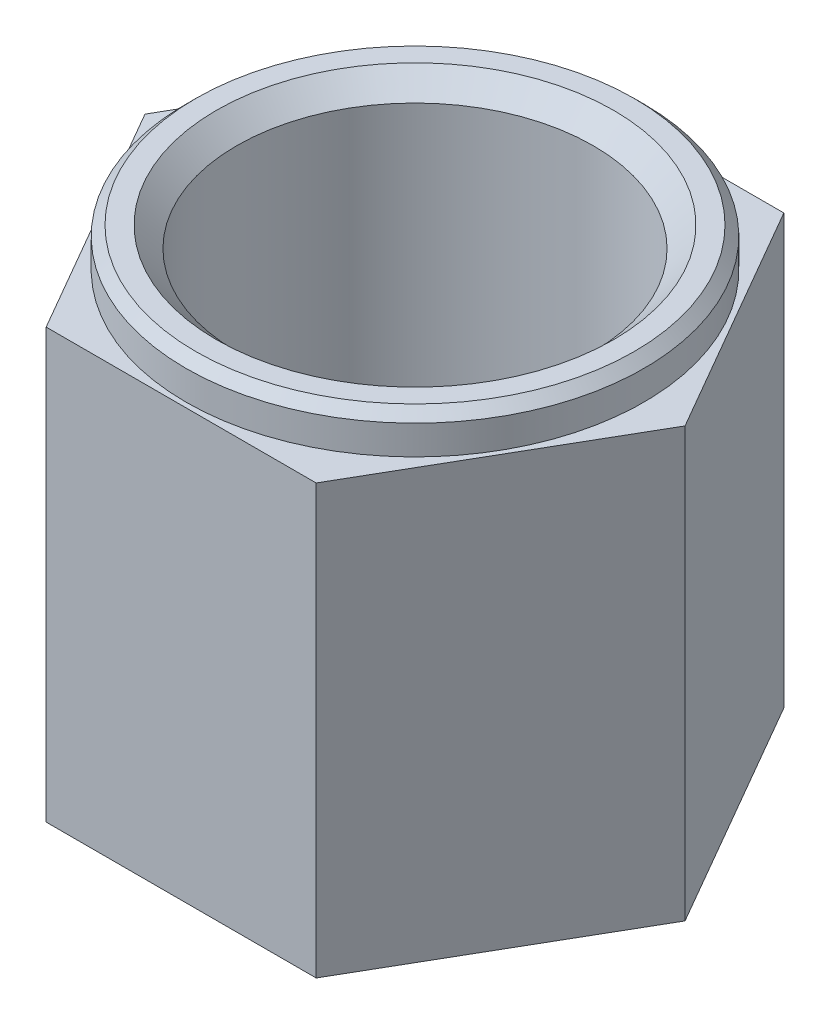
ISO-10303-21;
HEADER;
FILE_DESCRIPTION(('STEP AP214'),'2;1');
FILE_NAME('part.step','',(''),(''),'','','');
FILE_SCHEMA(('AUTOMOTIVE_DESIGN { 1 0 10303 214 1 1 1 1 }'));
ENDSEC;
DATA;
#1=APPLICATION_CONTEXT('core data for automotive mechanical design processes');
#2=APPLICATION_PROTOCOL_DEFINITION('international standard','automotive_design',2000,#1);
#3=PRODUCT_CONTEXT('',#1,'mechanical');
#4=PRODUCT('Part','Part','',(#3));
#5=PRODUCT_RELATED_PRODUCT_CATEGORY('part','',(#4));
#6=PRODUCT_DEFINITION_FORMATION('','',#4);
#7=PRODUCT_DEFINITION_CONTEXT('part definition',#1,'design');
#8=PRODUCT_DEFINITION('design','',#6,#7);
#9=PRODUCT_DEFINITION_SHAPE('','',#8);
#10=(LENGTH_UNIT() NAMED_UNIT(*) SI_UNIT(.MILLI.,.METRE.));
#11=(NAMED_UNIT(*) PLANE_ANGLE_UNIT() SI_UNIT($,.RADIAN.));
#12=(NAMED_UNIT(*) SI_UNIT($,.STERADIAN.) SOLID_ANGLE_UNIT());
#13=UNCERTAINTY_MEASURE_WITH_UNIT(LENGTH_MEASURE(1.E-05),#10,'distance_accuracy_value','');
#14=(GEOMETRIC_REPRESENTATION_CONTEXT(3) GLOBAL_UNCERTAINTY_ASSIGNED_CONTEXT((#13)) GLOBAL_UNIT_ASSIGNED_CONTEXT((#10,
#11,#12)) REPRESENTATION_CONTEXT('',''));
#15=CARTESIAN_POINT('',(0.,0.,0.));
#16=DIRECTION('',(0.,0.,1.));
#17=DIRECTION('',(1.,0.,0.));
#18=AXIS2_PLACEMENT_3D('',#15,#16,#17);
#19=CARTESIAN_POINT('',(6.92820323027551,24.,12.));
#20=DIRECTION('',(-0.866025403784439,0.,-0.5));
#21=DIRECTION('',(-0.5,0.,0.866025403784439));
#22=AXIS2_PLACEMENT_3D('',#19,#20,#21);
#23=PLANE('',#22);
#24=DIRECTION('',(0.,-1.,0.));
#25=VECTOR('',#24,1.);
#26=CARTESIAN_POINT('',(13.856406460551,24.,0.));
#27=LINE('',#26,#25);
#28=CARTESIAN_POINT('',(13.856406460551,22.,0.));
#29=VERTEX_POINT('',#28);
#30=CARTESIAN_POINT('',(13.856406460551,0.,0.));
#31=VERTEX_POINT('',#30);
#32=EDGE_CURVE('E92',#29,#31,#27,.T.);
#33=ORIENTED_EDGE('',*,*,#32,.F.);
#34=DIRECTION('',(-0.5,0.,0.866025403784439));
#35=VECTOR('',#34,1.);
#36=CARTESIAN_POINT('',(6.92820323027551,22.,12.));
#37=LINE('',#36,#35);
#38=CARTESIAN_POINT('',(6.92820323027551,22.,12.));
#39=VERTEX_POINT('',#38);
#40=EDGE_CURVE('E88',#29,#39,#37,.T.);
#41=ORIENTED_EDGE('',*,*,#40,.T.);
#42=DIRECTION('',(0.,-1.,0.));
#43=VECTOR('',#42,1.);
#44=CARTESIAN_POINT('',(6.92820323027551,24.,12.));
#45=LINE('',#44,#43);
#46=CARTESIAN_POINT('',(6.92820323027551,0.,12.));
#47=VERTEX_POINT('',#46);
#48=EDGE_CURVE('E57',#39,#47,#45,.T.);
#49=ORIENTED_EDGE('',*,*,#48,.T.);
#50=DIRECTION('',(0.5,0.,-0.866025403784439));
#51=VECTOR('',#50,1.);
#52=CARTESIAN_POINT('',(6.92820323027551,0.,12.));
#53=LINE('',#52,#51);
#54=EDGE_CURVE('E241',#47,#31,#53,.T.);
#55=ORIENTED_EDGE('',*,*,#54,.T.);
#56=EDGE_LOOP('',(#33,#41,#49,#55));
#57=FACE_BOUND('',#56,.T.);
#58=ADVANCED_FACE('F34',(#57),#23,.F.);
#59=CARTESIAN_POINT('',(13.856406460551,24.,0.));
#60=DIRECTION('',(-0.866025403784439,0.,0.5));
#61=DIRECTION('',(0.5,0.,0.866025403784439));
#62=AXIS2_PLACEMENT_3D('',#59,#60,#61);
#63=PLANE('',#62);
#64=DIRECTION('',(0.,-1.,0.));
#65=VECTOR('',#64,1.);
#66=CARTESIAN_POINT('',(6.9282032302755,24.,-12.));
#67=LINE('',#66,#65);
#68=CARTESIAN_POINT('',(6.9282032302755,22.,-12.));
#69=VERTEX_POINT('',#68);
#70=CARTESIAN_POINT('',(6.9282032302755,0.,-12.));
#71=VERTEX_POINT('',#70);
#72=EDGE_CURVE('E113',#69,#71,#67,.T.);
#73=ORIENTED_EDGE('',*,*,#72,.F.);
#74=DIRECTION('',(0.5,0.,0.866025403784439));
#75=VECTOR('',#74,1.);
#76=CARTESIAN_POINT('',(13.856406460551,22.,0.));
#77=LINE('',#76,#75);
#78=EDGE_CURVE('E96',#69,#29,#77,.T.);
#79=ORIENTED_EDGE('',*,*,#78,.T.);
#80=ORIENTED_EDGE('',*,*,#32,.T.);
#81=DIRECTION('',(-0.5,0.,-0.866025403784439));
#82=VECTOR('',#81,1.);
#83=CARTESIAN_POINT('',(13.856406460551,0.,0.));
#84=LINE('',#83,#82);
#85=EDGE_CURVE('E243',#31,#71,#84,.T.);
#86=ORIENTED_EDGE('',*,*,#85,.T.);
#87=EDGE_LOOP('',(#73,#79,#80,#86));
#88=FACE_BOUND('',#87,.T.);
#89=ADVANCED_FACE('F131',(#88),#63,.F.);
#90=CARTESIAN_POINT('',(6.9282032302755,24.,-12.));
#91=DIRECTION('',(0.,0.,1.));
#92=DIRECTION('',(1.,0.,0.));
#93=AXIS2_PLACEMENT_3D('',#90,#91,#92);
#94=PLANE('',#93);
#95=DIRECTION('',(0.,-1.,0.));
#96=VECTOR('',#95,1.);
#97=CARTESIAN_POINT('',(-6.92820323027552,24.,-12.));
#98=LINE('',#97,#96);
#99=CARTESIAN_POINT('',(-6.92820323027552,22.,-12.));
#100=VERTEX_POINT('',#99);
#101=CARTESIAN_POINT('',(-6.92820323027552,0.,-12.));
#102=VERTEX_POINT('',#101);
#103=EDGE_CURVE('E111',#100,#102,#98,.T.);
#104=ORIENTED_EDGE('',*,*,#103,.F.);
#105=DIRECTION('',(1.,0.,0.));
#106=VECTOR('',#105,1.);
#107=CARTESIAN_POINT('',(6.9282032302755,22.,-12.));
#108=LINE('',#107,#106);
#109=EDGE_CURVE('E208',#100,#69,#108,.T.);
#110=ORIENTED_EDGE('',*,*,#109,.T.);
#111=ORIENTED_EDGE('',*,*,#72,.T.);
#112=DIRECTION('',(-1.,0.,0.));
#113=VECTOR('',#112,1.);
#114=CARTESIAN_POINT('',(6.9282032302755,0.,-12.));
#115=LINE('',#114,#113);
#116=EDGE_CURVE('E246',#71,#102,#115,.T.);
#117=ORIENTED_EDGE('',*,*,#116,.T.);
#118=EDGE_LOOP('',(#104,#110,#111,#117));
#119=FACE_BOUND('',#118,.T.);
#120=ADVANCED_FACE('F135',(#119),#94,.F.);
#121=CARTESIAN_POINT('',(-6.92820323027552,24.,-12.));
#122=DIRECTION('',(0.866025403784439,0.,0.5));
#123=DIRECTION('',(0.5,0.,-0.866025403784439));
#124=AXIS2_PLACEMENT_3D('',#121,#122,#123);
#125=PLANE('',#124);
#126=DIRECTION('',(0.,-1.,0.));
#127=VECTOR('',#126,1.);
#128=CARTESIAN_POINT('',(-13.856406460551,24.,0.));
#129=LINE('',#128,#127);
#130=CARTESIAN_POINT('',(-13.856406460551,22.,0.));
#131=VERTEX_POINT('',#130);
#132=CARTESIAN_POINT('',(-13.856406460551,0.,0.));
#133=VERTEX_POINT('',#132);
#134=EDGE_CURVE('E104',#131,#133,#129,.T.);
#135=ORIENTED_EDGE('',*,*,#134,.F.);
#136=DIRECTION('',(0.5,0.,-0.866025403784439));
#137=VECTOR('',#136,1.);
#138=CARTESIAN_POINT('',(-6.92820323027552,22.,-12.));
#139=LINE('',#138,#137);
#140=EDGE_CURVE('E203',#131,#100,#139,.T.);
#141=ORIENTED_EDGE('',*,*,#140,.T.);
#142=ORIENTED_EDGE('',*,*,#103,.T.);
#143=DIRECTION('',(-0.5,0.,0.866025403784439));
#144=VECTOR('',#143,1.);
#145=CARTESIAN_POINT('',(-6.92820323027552,0.,-12.));
#146=LINE('',#145,#144);
#147=EDGE_CURVE('E249',#102,#133,#146,.T.);
#148=ORIENTED_EDGE('',*,*,#147,.T.);
#149=EDGE_LOOP('',(#135,#141,#142,#148));
#150=FACE_BOUND('',#149,.T.);
#151=ADVANCED_FACE('F141',(#150),#125,.F.);
#152=CARTESIAN_POINT('',(-13.856406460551,24.,0.));
#153=DIRECTION('',(0.866025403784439,0.,-0.5));
#154=DIRECTION('',(-0.5,0.,-0.866025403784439));
#155=AXIS2_PLACEMENT_3D('',#152,#153,#154);
#156=PLANE('',#155);
#157=DIRECTION('',(0.,-1.,0.));
#158=VECTOR('',#157,1.);
#159=CARTESIAN_POINT('',(-6.92820323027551,24.,12.));
#160=LINE('',#159,#158);
#161=CARTESIAN_POINT('',(-6.92820323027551,22.,12.));
#162=VERTEX_POINT('',#161);
#163=CARTESIAN_POINT('',(-6.92820323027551,0.,12.));
#164=VERTEX_POINT('',#163);
#165=EDGE_CURVE('E102',#162,#164,#160,.T.);
#166=ORIENTED_EDGE('',*,*,#165,.F.);
#167=DIRECTION('',(-0.5,0.,-0.866025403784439));
#168=VECTOR('',#167,1.);
#169=CARTESIAN_POINT('',(-13.856406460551,22.,0.));
#170=LINE('',#169,#168);
#171=EDGE_CURVE('E49',#162,#131,#170,.T.);
#172=ORIENTED_EDGE('',*,*,#171,.T.);
#173=ORIENTED_EDGE('',*,*,#134,.T.);
#174=DIRECTION('',(0.5,0.,0.866025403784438));
#175=VECTOR('',#174,1.);
#176=CARTESIAN_POINT('',(-13.856406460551,0.,0.));
#177=LINE('',#176,#175);
#178=EDGE_CURVE('E106',#133,#164,#177,.T.);
#179=ORIENTED_EDGE('',*,*,#178,.T.);
#180=EDGE_LOOP('',(#166,#172,#173,#179));
#181=FACE_BOUND('',#180,.T.);
#182=ADVANCED_FACE('F145',(#181),#156,.F.);
#183=CARTESIAN_POINT('',(-6.92820323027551,24.,12.));
#184=DIRECTION('',(0.,0.,-1.));
#185=DIRECTION('',(-1.,0.,0.));
#186=AXIS2_PLACEMENT_3D('',#183,#184,#185);
#187=PLANE('',#186);
#188=ORIENTED_EDGE('',*,*,#48,.F.);
#189=DIRECTION('',(-1.,0.,0.));
#190=VECTOR('',#189,1.);
#191=CARTESIAN_POINT('',(-6.92820323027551,22.,12.));
#192=LINE('',#191,#190);
#193=EDGE_CURVE('E86',#39,#162,#192,.T.);
#194=ORIENTED_EDGE('',*,*,#193,.T.);
#195=ORIENTED_EDGE('',*,*,#165,.T.);
#196=DIRECTION('',(1.,0.,0.));
#197=VECTOR('',#196,1.);
#198=CARTESIAN_POINT('',(-6.92820323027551,0.,12.));
#199=LINE('',#198,#197);
#200=EDGE_CURVE('E100',#164,#47,#199,.T.);
#201=ORIENTED_EDGE('',*,*,#200,.T.);
#202=EDGE_LOOP('',(#188,#194,#195,#201));
#203=FACE_BOUND('',#202,.T.);
#204=ADVANCED_FACE('F98',(#203),#187,.F.);
#205=CARTESIAN_POINT('',(13.856406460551,24.,0.));
#206=DIRECTION('',(0.,1.,0.));
#207=DIRECTION('',(0.,0.,1.));
#208=AXIS2_PLACEMENT_3D('',#205,#206,#207);
#209=PLANE('',#208);
#210=CARTESIAN_POINT('',(0.,24.,0.));
#211=DIRECTION('',(0.,1.,0.));
#212=DIRECTION('',(0.,0.,1.));
#213=AXIS2_PLACEMENT_3D('',#210,#211,#212);
#214=CIRCLE('',#213,11.25);
#215=CARTESIAN_POINT('',(0.,24.,11.25));
#216=VERTEX_POINT('',#215);
#217=EDGE_CURVE('E42',#216,#216,#214,.T.);
#218=ORIENTED_EDGE('',*,*,#217,.T.);
#219=EDGE_LOOP('',(#218));
#220=FACE_BOUND('',#219,.T.);
#221=CARTESIAN_POINT('',(0.,24.,0.));
#222=DIRECTION('',(0.,1.,0.));
#223=DIRECTION('',(0.,0.,1.));
#224=AXIS2_PLACEMENT_3D('',#221,#222,#223);
#225=CIRCLE('',#224,10.1945069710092);
#226=CARTESIAN_POINT('',(0.,24.,10.1945069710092));
#227=VERTEX_POINT('',#226);
#228=EDGE_CURVE('E95',#227,#227,#225,.T.);
#229=ORIENTED_EDGE('',*,*,#228,.F.);
#230=EDGE_LOOP('',(#229));
#231=FACE_BOUND('',#230,.T.);
#232=ADVANCED_FACE('F118',(#220,#231),#209,.T.);
#233=CARTESIAN_POINT('',(13.856406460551,0.,0.));
#234=DIRECTION('',(0.,1.,0.));
#235=DIRECTION('',(0.,0.,1.));
#236=AXIS2_PLACEMENT_3D('',#233,#234,#235);
#237=PLANE('',#236);
#238=CARTESIAN_POINT('',(0.,0.,0.));
#239=DIRECTION('',(0.,1.,0.));
#240=DIRECTION('',(0.,0.,1.));
#241=AXIS2_PLACEMENT_3D('',#238,#239,#240);
#242=CIRCLE('',#241,7.);
#243=CARTESIAN_POINT('',(0.,0.,7.));
#244=VERTEX_POINT('',#243);
#245=EDGE_CURVE('E238',#244,#244,#242,.T.);
#246=ORIENTED_EDGE('',*,*,#245,.T.);
#247=EDGE_LOOP('',(#246));
#248=FACE_BOUND('',#247,.T.);
#249=ORIENTED_EDGE('',*,*,#54,.F.);
#250=ORIENTED_EDGE('',*,*,#200,.F.);
#251=ORIENTED_EDGE('',*,*,#178,.F.);
#252=ORIENTED_EDGE('',*,*,#147,.F.);
#253=ORIENTED_EDGE('',*,*,#116,.F.);
#254=ORIENTED_EDGE('',*,*,#85,.F.);
#255=EDGE_LOOP('',(#249,#250,#251,#252,#253,#254));
#256=FACE_BOUND('',#255,.T.);
#257=ADVANCED_FACE('F152',(#248,#256),#237,.F.);
#258=CARTESIAN_POINT('',(0.,24.,0.));
#259=DIRECTION('',(0.,1.,0.));
#260=DIRECTION('',(0.,0.,1.));
#261=AXIS2_PLACEMENT_3D('',#258,#259,#260);
#262=CYLINDRICAL_SURFACE('',#261,7.);
#263=ORIENTED_EDGE('',*,*,#245,.F.);
#264=EDGE_LOOP('',(#263));
#265=FACE_BOUND('',#264,.T.);
#266=CARTESIAN_POINT('',(0.,3.5,0.));
#267=DIRECTION('',(0.,1.,0.));
#268=DIRECTION('',(0.,0.,1.));
#269=AXIS2_PLACEMENT_3D('',#266,#267,#268);
#270=CIRCLE('',#269,7.);
#271=CARTESIAN_POINT('',(0.,3.5,7.));
#272=VERTEX_POINT('',#271);
#273=EDGE_CURVE('E235',#272,#272,#270,.T.);
#274=ORIENTED_EDGE('',*,*,#273,.T.);
#275=EDGE_LOOP('',(#274));
#276=FACE_BOUND('',#275,.T.);
#277=ADVANCED_FACE('F155',(#265,#276),#262,.F.);
#278=CARTESIAN_POINT('',(0.,4.,0.));
#279=DIRECTION('',(0.,1.,0.));
#280=DIRECTION('',(0.,0.,1.));
#281=AXIS2_PLACEMENT_3D('',#278,#279,#280);
#282=CONICAL_SURFACE('',#281,7.5,0.785398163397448);
#283=ORIENTED_EDGE('',*,*,#273,.F.);
#284=EDGE_LOOP('',(#283));
#285=FACE_BOUND('',#284,.T.);
#286=CARTESIAN_POINT('',(0.,4.,0.));
#287=DIRECTION('',(0.,1.,0.));
#288=DIRECTION('',(0.,0.,1.));
#289=AXIS2_PLACEMENT_3D('',#286,#287,#288);
#290=CIRCLE('',#289,7.5);
#291=CARTESIAN_POINT('',(0.,4.,7.5));
#292=VERTEX_POINT('',#291);
#293=EDGE_CURVE('E232',#292,#292,#290,.T.);
#294=ORIENTED_EDGE('',*,*,#293,.T.);
#295=EDGE_LOOP('',(#294));
#296=FACE_BOUND('',#295,.T.);
#297=ADVANCED_FACE('F161',(#285,#296),#282,.F.);
#298=CARTESIAN_POINT('',(0.,4.,7.5));
#299=DIRECTION('',(0.,-1.,0.));
#300=DIRECTION('',(0.,0.,-1.));
#301=AXIS2_PLACEMENT_3D('',#298,#299,#300);
#302=PLANE('',#301);
#303=ORIENTED_EDGE('',*,*,#293,.F.);
#304=EDGE_LOOP('',(#303));
#305=FACE_BOUND('',#304,.T.);
#306=CARTESIAN_POINT('',(0.,4.,0.));
#307=DIRECTION('',(0.,1.,0.));
#308=DIRECTION('',(0.,0.,1.));
#309=AXIS2_PLACEMENT_3D('',#306,#307,#308);
#310=CIRCLE('',#309,9.6);
#311=CARTESIAN_POINT('',(0.,4.,9.6));
#312=VERTEX_POINT('',#311);
#313=EDGE_CURVE('E229',#312,#312,#310,.T.);
#314=ORIENTED_EDGE('',*,*,#313,.T.);
#315=EDGE_LOOP('',(#314));
#316=FACE_BOUND('',#315,.T.);
#317=ADVANCED_FACE('F165',(#305,#316),#302,.F.);
#318=CARTESIAN_POINT('',(0.,4.5,0.));
#319=DIRECTION('',(0.,1.,0.));
#320=DIRECTION('',(0.,0.,1.));
#321=AXIS2_PLACEMENT_3D('',#318,#319,#320);
#322=TOROIDAL_SURFACE('',#321,9.6,0.5);
#323=ORIENTED_EDGE('',*,*,#313,.F.);
#324=EDGE_LOOP('',(#323));
#325=FACE_BOUND('',#324,.T.);
#326=CARTESIAN_POINT('',(0.,4.5,0.));
#327=DIRECTION('',(0.,1.,0.));
#328=DIRECTION('',(0.,0.,1.));
#329=AXIS2_PLACEMENT_3D('',#326,#327,#328);
#330=CIRCLE('',#329,10.1);
#331=CARTESIAN_POINT('',(0.,4.5,10.1));
#332=VERTEX_POINT('',#331);
#333=EDGE_CURVE('E226',#332,#332,#330,.T.);
#334=ORIENTED_EDGE('',*,*,#333,.T.);
#335=EDGE_LOOP('',(#334));
#336=FACE_BOUND('',#335,.T.);
#337=ADVANCED_FACE('F169',(#325,#336),#322,.F.);
#338=CARTESIAN_POINT('',(0.,24.,0.));
#339=DIRECTION('',(0.,1.,0.));
#340=DIRECTION('',(0.,0.,1.));
#341=AXIS2_PLACEMENT_3D('',#338,#339,#340);
#342=CYLINDRICAL_SURFACE('',#341,10.1);
#343=ORIENTED_EDGE('',*,*,#333,.F.);
#344=EDGE_LOOP('',(#343));
#345=FACE_BOUND('',#344,.T.);
#346=CARTESIAN_POINT('',(0.,7.8,0.));
#347=DIRECTION('',(0.,1.,0.));
#348=DIRECTION('',(0.,0.,1.));
#349=AXIS2_PLACEMENT_3D('',#346,#347,#348);
#350=CIRCLE('',#349,10.1);
#351=CARTESIAN_POINT('',(0.,7.8,10.1));
#352=VERTEX_POINT('',#351);
#353=EDGE_CURVE('E223',#352,#352,#350,.T.);
#354=ORIENTED_EDGE('',*,*,#353,.T.);
#355=EDGE_LOOP('',(#354));
#356=FACE_BOUND('',#355,.T.);
#357=ADVANCED_FACE('F173',(#345,#356),#342,.F.);
#358=CARTESIAN_POINT('',(0.,7.8,0.));
#359=DIRECTION('',(0.,1.,0.));
#360=DIRECTION('',(0.,0.,1.));
#361=AXIS2_PLACEMENT_3D('',#358,#359,#360);
#362=TOROIDAL_SURFACE('',#361,9.6,0.5);
#363=ORIENTED_EDGE('',*,*,#353,.F.);
#364=EDGE_LOOP('',(#363));
#365=FACE_BOUND('',#364,.T.);
#366=CARTESIAN_POINT('',(0.,8.10312788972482,0.));
#367=DIRECTION('',(0.,1.,0.));
#368=DIRECTION('',(0.,0.,1.));
#369=AXIS2_PLACEMENT_3D('',#366,#367,#368);
#370=CIRCLE('',#369,9.99763486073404);
#371=CARTESIAN_POINT('',(0.,8.10312788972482,9.99763486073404));
#372=VERTEX_POINT('',#371);
#373=EDGE_CURVE('E220',#372,#372,#370,.T.);
#374=ORIENTED_EDGE('',*,*,#373,.T.);
#375=EDGE_LOOP('',(#374));
#376=FACE_BOUND('',#375,.T.);
#377=ADVANCED_FACE('F177',(#365,#376),#362,.F.);
#378=CARTESIAN_POINT('',(0.,8.95312788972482,0.));
#379=DIRECTION('',(0.,-1.,0.));
#380=DIRECTION('',(0.,0.,-1.));
#381=AXIS2_PLACEMENT_3D('',#378,#379,#380);
#382=CONICAL_SURFACE('',#381,9.14763486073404,0.785398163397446);
#383=ORIENTED_EDGE('',*,*,#373,.F.);
#384=EDGE_LOOP('',(#383));
#385=FACE_BOUND('',#384,.T.);
#386=CARTESIAN_POINT('',(0.,8.95312788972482,0.));
#387=DIRECTION('',(0.,1.,0.));
#388=DIRECTION('',(0.,0.,1.));
#389=AXIS2_PLACEMENT_3D('',#386,#387,#388);
#390=CIRCLE('',#389,9.14763486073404);
#391=CARTESIAN_POINT('',(0.,8.95312788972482,9.14763486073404));
#392=VERTEX_POINT('',#391);
#393=EDGE_CURVE('E217',#392,#392,#390,.T.);
#394=ORIENTED_EDGE('',*,*,#393,.T.);
#395=EDGE_LOOP('',(#394));
#396=FACE_BOUND('',#395,.T.);
#397=ADVANCED_FACE('F181',(#385,#396),#382,.F.);
#398=CARTESIAN_POINT('',(0.,24.,0.));
#399=DIRECTION('',(0.,1.,0.));
#400=DIRECTION('',(0.,0.,1.));
#401=AXIS2_PLACEMENT_3D('',#398,#399,#400);
#402=CYLINDRICAL_SURFACE('',#401,9.14763486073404);
#403=ORIENTED_EDGE('',*,*,#393,.F.);
#404=EDGE_LOOP('',(#403));
#405=FACE_BOUND('',#404,.T.);
#406=CARTESIAN_POINT('',(0.,22.9531278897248,0.));
#407=DIRECTION('',(0.,1.,0.));
#408=DIRECTION('',(0.,0.,1.));
#409=AXIS2_PLACEMENT_3D('',#406,#407,#408);
#410=CIRCLE('',#409,9.14763486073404);
#411=CARTESIAN_POINT('',(0.,22.9531278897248,9.14763486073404));
#412=VERTEX_POINT('',#411);
#413=EDGE_CURVE('E214',#412,#412,#410,.T.);
#414=ORIENTED_EDGE('',*,*,#413,.T.);
#415=EDGE_LOOP('',(#414));
#416=FACE_BOUND('',#415,.T.);
#417=ADVANCED_FACE('F185',(#405,#416),#402,.F.);
#418=CARTESIAN_POINT('',(0.,24.,0.));
#419=DIRECTION('',(0.,1.,0.));
#420=DIRECTION('',(0.,0.,1.));
#421=AXIS2_PLACEMENT_3D('',#418,#419,#420);
#422=CONICAL_SURFACE('',#421,10.1945069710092,0.785398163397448);
#423=ORIENTED_EDGE('',*,*,#413,.F.);
#424=EDGE_LOOP('',(#423));
#425=FACE_BOUND('',#424,.T.);
#426=ORIENTED_EDGE('',*,*,#228,.T.);
#427=EDGE_LOOP('',(#426));
#428=FACE_BOUND('',#427,.T.);
#429=ADVANCED_FACE('F189',(#425,#428),#422,.F.);
#430=CARTESIAN_POINT('',(0.,22.,16.75));
#431=DIRECTION('',(0.,-1.,0.));
#432=DIRECTION('',(0.,0.,-1.));
#433=AXIS2_PLACEMENT_3D('',#430,#431,#432);
#434=PLANE('',#433);
#435=CARTESIAN_POINT('',(0.,22.,0.));
#436=DIRECTION('',(0.,1.,0.));
#437=DIRECTION('',(0.,0.,1.));
#438=AXIS2_PLACEMENT_3D('',#435,#436,#437);
#439=CIRCLE('',#438,11.75);
#440=CARTESIAN_POINT('',(0.,22.,11.75));
#441=VERTEX_POINT('',#440);
#442=EDGE_CURVE('E200',#441,#441,#439,.T.);
#443=ORIENTED_EDGE('',*,*,#442,.F.);
#444=EDGE_LOOP('',(#443));
#445=FACE_BOUND('',#444,.T.);
#446=ORIENTED_EDGE('',*,*,#78,.F.);
#447=ORIENTED_EDGE('',*,*,#109,.F.);
#448=ORIENTED_EDGE('',*,*,#140,.F.);
#449=ORIENTED_EDGE('',*,*,#171,.F.);
#450=ORIENTED_EDGE('',*,*,#193,.F.);
#451=ORIENTED_EDGE('',*,*,#40,.F.);
#452=EDGE_LOOP('',(#446,#447,#448,#449,#450,#451));
#453=FACE_BOUND('',#452,.T.);
#454=ADVANCED_FACE('F87',(#445,#453),#434,.F.);
#455=CARTESIAN_POINT('',(0.,24.,0.));
#456=DIRECTION('',(0.,1.,0.));
#457=DIRECTION('',(0.,0.,1.));
#458=AXIS2_PLACEMENT_3D('',#455,#456,#457);
#459=CYLINDRICAL_SURFACE('',#458,11.75);
#460=CARTESIAN_POINT('',(0.,23.5,0.));
#461=DIRECTION('',(0.,1.,0.));
#462=DIRECTION('',(0.,0.,1.));
#463=AXIS2_PLACEMENT_3D('',#460,#461,#462);
#464=CIRCLE('',#463,11.75);
#465=CARTESIAN_POINT('',(0.,23.5,11.75));
#466=VERTEX_POINT('',#465);
#467=EDGE_CURVE('E11',#466,#466,#464,.F.);
#468=ORIENTED_EDGE('',*,*,#467,.T.);
#469=EDGE_LOOP('',(#468));
#470=FACE_BOUND('',#469,.T.);
#471=ORIENTED_EDGE('',*,*,#442,.T.);
#472=EDGE_LOOP('',(#471));
#473=FACE_BOUND('',#472,.T.);
#474=ADVANCED_FACE('F122',(#470,#473),#459,.T.);
#475=CARTESIAN_POINT('',(0.,24.,0.));
#476=DIRECTION('',(0.,-1.,0.));
#477=DIRECTION('',(0.,0.,-1.));
#478=AXIS2_PLACEMENT_3D('',#475,#476,#477);
#479=CONICAL_SURFACE('',#478,11.25,0.785398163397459);
#480=ORIENTED_EDGE('',*,*,#467,.F.);
#481=EDGE_LOOP('',(#480));
#482=FACE_BOUND('',#481,.T.);
#483=ORIENTED_EDGE('',*,*,#217,.F.);
#484=EDGE_LOOP('',(#483));
#485=FACE_BOUND('',#484,.T.);
#486=ADVANCED_FACE('F36',(#482,#485),#479,.T.);
#487=CLOSED_SHELL('',(#58,#89,#120,#151,#182,#204,#232,#257,#277,#297,#317,#337,#357,#377,#397,
#417,#429,#454,#474,#486));
#488=MANIFOLD_SOLID_BREP('B2',#487);
#489=ADVANCED_BREP_SHAPE_REPRESENTATION('',(#18,#488),#14);
#490=SHAPE_DEFINITION_REPRESENTATION(#9,#489);
ENDSEC;
END-ISO-10303-21;
